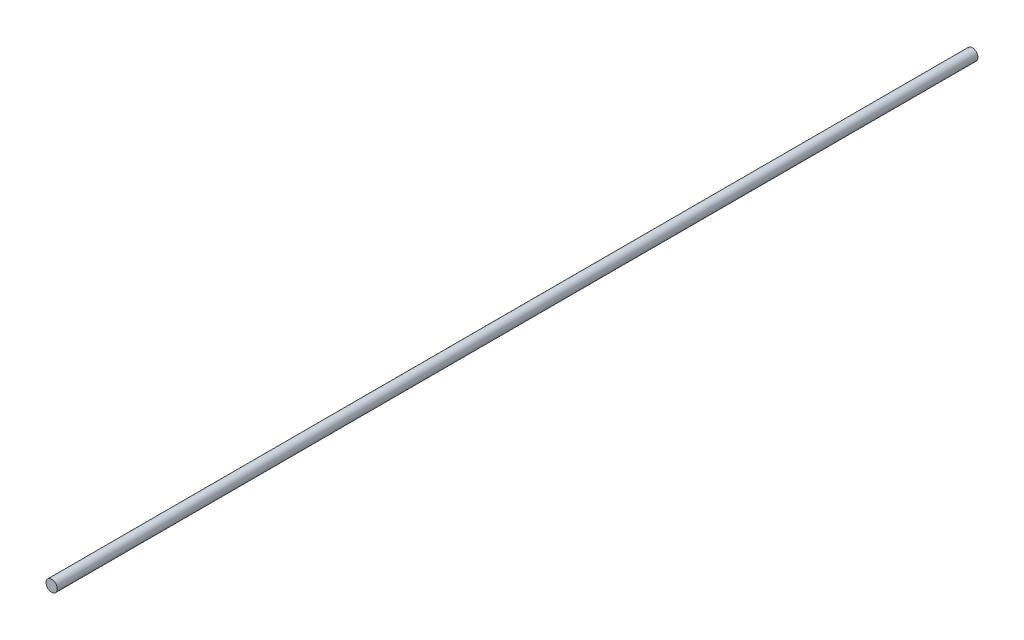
from build123d import *

# Parameters (mm, degrees)
SKETCH1_R           = 30
BOSS_EXTRUDE1_DEPTH = 4900


with BuildPart() as part:
    # Sketch1 → Boss-Extrude1 (new body)
    with BuildSketch(Plane.XY):
        Circle(SKETCH1_R)
    extrude(amount=-BOSS_EXTRUDE1_DEPTH)


solid = part.part
